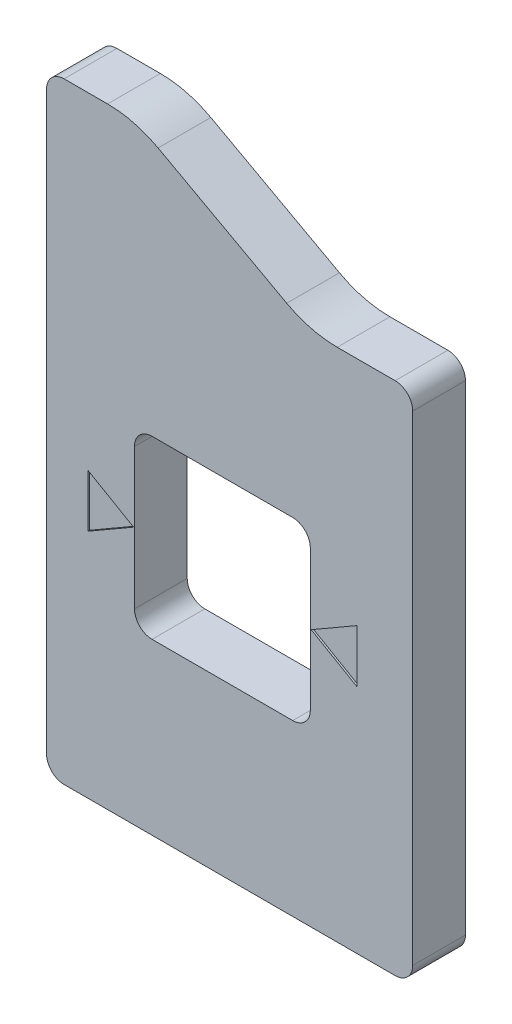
ISO-10303-21;
HEADER;
FILE_DESCRIPTION(('STEP AP214'),'2;1');
FILE_NAME('part.step','',(''),(''),'','','');
FILE_SCHEMA(('AUTOMOTIVE_DESIGN { 1 0 10303 214 1 1 1 1 }'));
ENDSEC;
DATA;
#1=APPLICATION_CONTEXT('core data for automotive mechanical design processes');
#2=APPLICATION_PROTOCOL_DEFINITION('international standard','automotive_design',2000,#1);
#3=PRODUCT_CONTEXT('',#1,'mechanical');
#4=PRODUCT('Part','Part','',(#3));
#5=PRODUCT_RELATED_PRODUCT_CATEGORY('part','',(#4));
#6=PRODUCT_DEFINITION_FORMATION('','',#4);
#7=PRODUCT_DEFINITION_CONTEXT('part definition',#1,'design');
#8=PRODUCT_DEFINITION('design','',#6,#7);
#9=PRODUCT_DEFINITION_SHAPE('','',#8);
#10=(LENGTH_UNIT() NAMED_UNIT(*) SI_UNIT(.MILLI.,.METRE.));
#11=(NAMED_UNIT(*) PLANE_ANGLE_UNIT() SI_UNIT($,.RADIAN.));
#12=(NAMED_UNIT(*) SI_UNIT($,.STERADIAN.) SOLID_ANGLE_UNIT());
#13=UNCERTAINTY_MEASURE_WITH_UNIT(LENGTH_MEASURE(1.E-05),#10,'distance_accuracy_value','');
#14=(GEOMETRIC_REPRESENTATION_CONTEXT(3) GLOBAL_UNCERTAINTY_ASSIGNED_CONTEXT((#13)) GLOBAL_UNIT_ASSIGNED_CONTEXT((#10,
#11,#12)) REPRESENTATION_CONTEXT('',''));
#15=CARTESIAN_POINT('',(0.,0.,0.));
#16=DIRECTION('',(0.,0.,1.));
#17=DIRECTION('',(1.,0.,0.));
#18=AXIS2_PLACEMENT_3D('',#15,#16,#17);
#19=CARTESIAN_POINT('',(14.8224463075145,-41.665103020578,6.));
#20=DIRECTION('',(0.,0.,1.));
#21=DIRECTION('',(1.,0.,0.));
#22=AXIS2_PLACEMENT_3D('',#19,#20,#21);
#23=PLANE('',#22);
#24=DIRECTION('',(0.866025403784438,0.500000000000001,0.));
#25=VECTOR('',#24,1.);
#26=CARTESIAN_POINT('',(-2.64807621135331,-29.5143211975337,6.));
#27=LINE('',#26,#25);
#28=CARTESIAN_POINT('',(-2.64807621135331,-29.5143211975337,6.));
#29=VERTEX_POINT('',#28);
#30=CARTESIAN_POINT('',(-0.049999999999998,-28.0143211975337,6.));
#31=VERTEX_POINT('',#30);
#32=EDGE_CURVE('E48',#29,#31,#27,.T.);
#33=ORIENTED_EDGE('',*,*,#32,.F.);
#34=DIRECTION('',(0.,-1.,0.));
#35=VECTOR('',#34,1.);
#36=CARTESIAN_POINT('',(-2.64807621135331,-26.5143211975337,6.));
#37=LINE('',#36,#35);
#38=CARTESIAN_POINT('',(-2.64807621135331,-26.5143211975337,6.));
#39=VERTEX_POINT('',#38);
#40=EDGE_CURVE('E223',#39,#29,#37,.T.);
#41=ORIENTED_EDGE('',*,*,#40,.F.);
#42=DIRECTION('',(-0.866025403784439,0.499999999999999,0.));
#43=VECTOR('',#42,1.);
#44=CARTESIAN_POINT('',(-0.0499999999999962,-28.0143211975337,6.));
#45=LINE('',#44,#43);
#46=EDGE_CURVE('E226',#31,#39,#45,.T.);
#47=ORIENTED_EDGE('',*,*,#46,.F.);
#48=EDGE_LOOP('',(#33,#41,#47));
#49=FACE_BOUND('',#48,.T.);
#50=DIRECTION('',(0.,1.,0.));
#51=VECTOR('',#50,1.);
#52=CARTESIAN_POINT('',(12.6480762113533,-26.5143211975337,6.));
#53=LINE('',#52,#51);
#54=CARTESIAN_POINT('',(12.6480762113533,-29.5143211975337,6.));
#55=VERTEX_POINT('',#54);
#56=CARTESIAN_POINT('',(12.6480762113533,-26.5143211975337,6.));
#57=VERTEX_POINT('',#56);
#58=EDGE_CURVE('E56',#55,#57,#53,.T.);
#59=ORIENTED_EDGE('',*,*,#58,.F.);
#60=DIRECTION('',(0.866025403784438,-0.500000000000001,0.));
#61=VECTOR('',#60,1.);
#62=CARTESIAN_POINT('',(12.6480762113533,-29.5143211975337,6.));
#63=LINE('',#62,#61);
#64=CARTESIAN_POINT('',(10.05,-28.0143211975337,6.));
#65=VERTEX_POINT('',#64);
#66=EDGE_CURVE('E241',#65,#55,#63,.T.);
#67=ORIENTED_EDGE('',*,*,#66,.F.);
#68=DIRECTION('',(-0.866025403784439,-0.5,0.));
#69=VECTOR('',#68,1.);
#70=CARTESIAN_POINT('',(10.05,-28.0143211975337,6.));
#71=LINE('',#70,#69);
#72=EDGE_CURVE('E249',#57,#65,#71,.T.);
#73=ORIENTED_EDGE('',*,*,#72,.F.);
#74=EDGE_LOOP('',(#59,#67,#73));
#75=FACE_BOUND('',#74,.T.);
#76=CARTESIAN_POINT('',(14.8224463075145,-41.665103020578,6.));
#77=DIRECTION('',(0.,0.,1.));
#78=DIRECTION('',(1.,0.,0.));
#79=AXIS2_PLACEMENT_3D('',#76,#77,#78);
#80=CIRCLE('',#79,1.);
#81=CARTESIAN_POINT('',(14.8224463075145,-42.665103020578,6.));
#82=VERTEX_POINT('',#81);
#83=CARTESIAN_POINT('',(15.8224463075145,-41.665103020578,6.));
#84=VERTEX_POINT('',#83);
#85=EDGE_CURVE('E317',#82,#84,#80,.T.);
#86=ORIENTED_EDGE('',*,*,#85,.T.);
#87=DIRECTION('',(0.,1.,0.));
#88=VECTOR('',#87,1.);
#89=CARTESIAN_POINT('',(15.8224463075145,-41.665103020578,6.));
#90=LINE('',#89,#88);
#91=CARTESIAN_POINT('',(15.8224463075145,-14.3635393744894,6.));
#92=VERTEX_POINT('',#91);
#93=EDGE_CURVE('E320',#84,#92,#90,.T.);
#94=ORIENTED_EDGE('',*,*,#93,.T.);
#95=CARTESIAN_POINT('',(14.8224463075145,-14.3635393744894,6.));
#96=DIRECTION('',(0.,0.,1.));
#97=DIRECTION('',(1.,0.,0.));
#98=AXIS2_PLACEMENT_3D('',#95,#96,#97);
#99=CIRCLE('',#98,1.);
#100=CARTESIAN_POINT('',(14.8224463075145,-13.3635393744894,6.));
#101=VERTEX_POINT('',#100);
#102=EDGE_CURVE('E323',#92,#101,#99,.T.);
#103=ORIENTED_EDGE('',*,*,#102,.T.);
#104=DIRECTION('',(-1.,0.,0.));
#105=VECTOR('',#104,1.);
#106=CARTESIAN_POINT('',(14.8224463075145,-13.3635393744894,6.));
#107=LINE('',#106,#105);
#108=CARTESIAN_POINT('',(11.52974146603,-13.3635393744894,6.));
#109=VERTEX_POINT('',#108);
#110=EDGE_CURVE('E325',#101,#109,#107,.T.);
#111=ORIENTED_EDGE('',*,*,#110,.T.);
#112=CARTESIAN_POINT('',(11.52974146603,-7.36353937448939,6.));
#113=DIRECTION('',(0.,0.,-1.));
#114=DIRECTION('',(-1.,0.,0.));
#115=AXIS2_PLACEMENT_3D('',#112,#113,#114);
#116=CIRCLE('',#115,6.);
#117=CARTESIAN_POINT('',(8.65699570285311,-12.6311129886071,6.));
#118=VERTEX_POINT('',#117);
#119=EDGE_CURVE('E327',#109,#118,#116,.T.);
#120=ORIENTED_EDGE('',*,*,#119,.T.);
#121=DIRECTION('',(-0.877928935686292,0.478790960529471,0.));
#122=VECTOR('',#121,1.);
#123=CARTESIAN_POINT('',(1.34300429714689,-8.64232434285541,6.));
#124=LINE('',#123,#122);
#125=CARTESIAN_POINT('',(1.34300429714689,-8.64232434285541,6.));
#126=VERTEX_POINT('',#125);
#127=EDGE_CURVE('E329',#118,#126,#124,.T.);
#128=ORIENTED_EDGE('',*,*,#127,.T.);
#129=CARTESIAN_POINT('',(-1.52974146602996,-13.9098979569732,6.));
#130=DIRECTION('',(0.,0.,1.));
#131=DIRECTION('',(-1.,0.,0.));
#132=AXIS2_PLACEMENT_3D('',#129,#130,#131);
#133=CIRCLE('',#132,6.);
#134=CARTESIAN_POINT('',(-1.52974146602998,-7.90989795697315,6.));
#135=VERTEX_POINT('',#134);
#136=EDGE_CURVE('E331',#126,#135,#133,.T.);
#137=ORIENTED_EDGE('',*,*,#136,.T.);
#138=DIRECTION('',(-1.,0.,0.));
#139=VECTOR('',#138,1.);
#140=CARTESIAN_POINT('',(-1.52974146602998,-7.90989795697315,6.));
#141=LINE('',#140,#139);
#142=CARTESIAN_POINT('',(-4.,-7.90989795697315,6.));
#143=VERTEX_POINT('',#142);
#144=EDGE_CURVE('E333',#135,#143,#141,.T.);
#145=ORIENTED_EDGE('',*,*,#144,.T.);
#146=CARTESIAN_POINT('',(-4.,-8.90989795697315,6.));
#147=DIRECTION('',(0.,0.,1.));
#148=DIRECTION('',(1.,0.,0.));
#149=AXIS2_PLACEMENT_3D('',#146,#147,#148);
#150=CIRCLE('',#149,1.);
#151=CARTESIAN_POINT('',(-5.,-8.90989795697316,6.));
#152=VERTEX_POINT('',#151);
#153=EDGE_CURVE('E335',#143,#152,#150,.T.);
#154=ORIENTED_EDGE('',*,*,#153,.T.);
#155=DIRECTION('',(0.,-1.,0.));
#156=VECTOR('',#155,1.);
#157=CARTESIAN_POINT('',(-5.,-8.90989795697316,6.));
#158=LINE('',#157,#156);
#159=CARTESIAN_POINT('',(-5.,-41.665103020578,6.));
#160=VERTEX_POINT('',#159);
#161=EDGE_CURVE('E337',#152,#160,#158,.T.);
#162=ORIENTED_EDGE('',*,*,#161,.T.);
#163=CARTESIAN_POINT('',(-4.,-41.665103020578,6.));
#164=DIRECTION('',(0.,0.,1.));
#165=DIRECTION('',(1.,0.,0.));
#166=AXIS2_PLACEMENT_3D('',#163,#164,#165);
#167=CIRCLE('',#166,1.);
#168=CARTESIAN_POINT('',(-4.,-42.665103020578,6.));
#169=VERTEX_POINT('',#168);
#170=EDGE_CURVE('E339',#160,#169,#167,.T.);
#171=ORIENTED_EDGE('',*,*,#170,.T.);
#172=DIRECTION('',(1.,0.,0.));
#173=VECTOR('',#172,1.);
#174=CARTESIAN_POINT('',(-4.,-42.665103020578,6.));
#175=LINE('',#174,#173);
#176=EDGE_CURVE('E341',#169,#82,#175,.T.);
#177=ORIENTED_EDGE('',*,*,#176,.T.);
#178=EDGE_LOOP('',(#86,#94,#103,#111,#120,#128,#137,#145,#154,#162,#171,#177));
#179=FACE_BOUND('',#178,.T.);
#180=DIRECTION('',(1.,0.,0.));
#181=VECTOR('',#180,1.);
#182=CARTESIAN_POINT('',(1.,-33.0143211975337,6.));
#183=LINE('',#182,#181);
#184=CARTESIAN_POINT('',(1.,-33.0143211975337,6.));
#185=VERTEX_POINT('',#184);
#186=CARTESIAN_POINT('',(9.00000000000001,-33.0143211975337,6.));
#187=VERTEX_POINT('',#186);
#188=EDGE_CURVE('E260',#185,#187,#183,.T.);
#189=ORIENTED_EDGE('',*,*,#188,.F.);
#190=CARTESIAN_POINT('',(1.,-32.0143211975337,6.));
#191=DIRECTION('',(0.,0.,1.));
#192=DIRECTION('',(1.,0.,0.));
#193=AXIS2_PLACEMENT_3D('',#190,#191,#192);
#194=CIRCLE('',#193,1.);
#195=CARTESIAN_POINT('',(0.,-32.0143211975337,6.));
#196=VERTEX_POINT('',#195);
#197=EDGE_CURVE('E258',#196,#185,#194,.T.);
#198=ORIENTED_EDGE('',*,*,#197,.F.);
#199=DIRECTION('',(0.,-1.,0.));
#200=VECTOR('',#199,1.);
#201=CARTESIAN_POINT('',(0.,-24.0143211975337,6.));
#202=LINE('',#201,#200);
#203=CARTESIAN_POINT('',(0.,-24.0143211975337,6.));
#204=VERTEX_POINT('',#203);
#205=EDGE_CURVE('E274',#204,#196,#202,.T.);
#206=ORIENTED_EDGE('',*,*,#205,.F.);
#207=CARTESIAN_POINT('',(1.,-24.0143211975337,6.));
#208=DIRECTION('',(0.,0.,1.));
#209=DIRECTION('',(1.,0.,0.));
#210=AXIS2_PLACEMENT_3D('',#207,#208,#209);
#211=CIRCLE('',#210,1.);
#212=CARTESIAN_POINT('',(1.,-23.0143211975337,6.));
#213=VERTEX_POINT('',#212);
#214=EDGE_CURVE('E271',#213,#204,#211,.T.);
#215=ORIENTED_EDGE('',*,*,#214,.F.);
#216=DIRECTION('',(-1.,0.,0.));
#217=VECTOR('',#216,1.);
#218=CARTESIAN_POINT('',(1.,-23.0143211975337,6.));
#219=LINE('',#218,#217);
#220=CARTESIAN_POINT('',(9.00000000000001,-23.0143211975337,6.));
#221=VERTEX_POINT('',#220);
#222=EDGE_CURVE('E269',#221,#213,#219,.T.);
#223=ORIENTED_EDGE('',*,*,#222,.F.);
#224=CARTESIAN_POINT('',(9.00000000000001,-24.0143211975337,6.));
#225=DIRECTION('',(0.,0.,1.));
#226=DIRECTION('',(-1.,0.,0.));
#227=AXIS2_PLACEMENT_3D('',#224,#225,#226);
#228=CIRCLE('',#227,1.);
#229=CARTESIAN_POINT('',(10.,-24.0143211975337,6.));
#230=VERTEX_POINT('',#229);
#231=EDGE_CURVE('E267',#230,#221,#228,.T.);
#232=ORIENTED_EDGE('',*,*,#231,.F.);
#233=DIRECTION('',(0.,1.,0.));
#234=VECTOR('',#233,1.);
#235=CARTESIAN_POINT('',(10.,-24.0143211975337,6.));
#236=LINE('',#235,#234);
#237=CARTESIAN_POINT('',(10.,-32.0143211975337,6.));
#238=VERTEX_POINT('',#237);
#239=EDGE_CURVE('E265',#238,#230,#236,.T.);
#240=ORIENTED_EDGE('',*,*,#239,.F.);
#241=CARTESIAN_POINT('',(9.00000000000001,-32.0143211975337,6.));
#242=DIRECTION('',(0.,0.,1.));
#243=DIRECTION('',(1.,0.,0.));
#244=AXIS2_PLACEMENT_3D('',#241,#242,#243);
#245=CIRCLE('',#244,1.);
#246=EDGE_CURVE('E263',#187,#238,#245,.T.);
#247=ORIENTED_EDGE('',*,*,#246,.F.);
#248=EDGE_LOOP('',(#189,#198,#206,#215,#223,#232,#240,#247));
#249=FACE_BOUND('',#248,.T.);
#250=ADVANCED_FACE('F33',(#49,#75,#179,#249),#23,.T.);
#251=CARTESIAN_POINT('',(14.8224463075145,-41.665103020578,3.));
#252=DIRECTION('',(0.,0.,1.));
#253=DIRECTION('',(1.,0.,0.));
#254=AXIS2_PLACEMENT_3D('',#251,#252,#253);
#255=PLANE('',#254);
#256=CARTESIAN_POINT('',(14.8224463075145,-41.665103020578,3.));
#257=DIRECTION('',(0.,0.,1.));
#258=DIRECTION('',(1.,0.,0.));
#259=AXIS2_PLACEMENT_3D('',#256,#257,#258);
#260=CIRCLE('',#259,1.);
#261=CARTESIAN_POINT('',(14.8224463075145,-42.665103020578,3.));
#262=VERTEX_POINT('',#261);
#263=CARTESIAN_POINT('',(15.8224463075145,-41.665103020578,3.));
#264=VERTEX_POINT('',#263);
#265=EDGE_CURVE('E316',#262,#264,#260,.T.);
#266=ORIENTED_EDGE('',*,*,#265,.F.);
#267=DIRECTION('',(1.,0.,0.));
#268=VECTOR('',#267,1.);
#269=CARTESIAN_POINT('',(-4.,-42.665103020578,3.));
#270=LINE('',#269,#268);
#271=CARTESIAN_POINT('',(-4.,-42.665103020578,3.));
#272=VERTEX_POINT('',#271);
#273=EDGE_CURVE('E321',#272,#262,#270,.T.);
#274=ORIENTED_EDGE('',*,*,#273,.F.);
#275=CARTESIAN_POINT('',(-4.,-41.665103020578,3.));
#276=DIRECTION('',(0.,0.,1.));
#277=DIRECTION('',(1.,0.,0.));
#278=AXIS2_PLACEMENT_3D('',#275,#276,#277);
#279=CIRCLE('',#278,1.);
#280=CARTESIAN_POINT('',(-5.,-41.665103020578,3.));
#281=VERTEX_POINT('',#280);
#282=EDGE_CURVE('E364',#281,#272,#279,.T.);
#283=ORIENTED_EDGE('',*,*,#282,.F.);
#284=DIRECTION('',(0.,-1.,0.));
#285=VECTOR('',#284,1.);
#286=CARTESIAN_POINT('',(-5.,-8.90989795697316,3.));
#287=LINE('',#286,#285);
#288=CARTESIAN_POINT('',(-5.,-8.90989795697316,3.));
#289=VERTEX_POINT('',#288);
#290=EDGE_CURVE('E362',#289,#281,#287,.T.);
#291=ORIENTED_EDGE('',*,*,#290,.F.);
#292=CARTESIAN_POINT('',(-4.,-8.90989795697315,3.));
#293=DIRECTION('',(0.,0.,1.));
#294=DIRECTION('',(1.,0.,0.));
#295=AXIS2_PLACEMENT_3D('',#292,#293,#294);
#296=CIRCLE('',#295,1.);
#297=CARTESIAN_POINT('',(-4.,-7.90989795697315,3.));
#298=VERTEX_POINT('',#297);
#299=EDGE_CURVE('E360',#298,#289,#296,.T.);
#300=ORIENTED_EDGE('',*,*,#299,.F.);
#301=DIRECTION('',(-1.,0.,0.));
#302=VECTOR('',#301,1.);
#303=CARTESIAN_POINT('',(-1.52974146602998,-7.90989795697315,3.));
#304=LINE('',#303,#302);
#305=CARTESIAN_POINT('',(-1.52974146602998,-7.90989795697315,3.));
#306=VERTEX_POINT('',#305);
#307=EDGE_CURVE('E358',#306,#298,#304,.T.);
#308=ORIENTED_EDGE('',*,*,#307,.F.);
#309=CARTESIAN_POINT('',(-1.52974146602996,-13.9098979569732,3.));
#310=DIRECTION('',(0.,0.,1.));
#311=DIRECTION('',(-1.,0.,0.));
#312=AXIS2_PLACEMENT_3D('',#309,#310,#311);
#313=CIRCLE('',#312,6.);
#314=CARTESIAN_POINT('',(1.34300429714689,-8.64232434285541,3.));
#315=VERTEX_POINT('',#314);
#316=EDGE_CURVE('E356',#315,#306,#313,.T.);
#317=ORIENTED_EDGE('',*,*,#316,.F.);
#318=DIRECTION('',(-0.877928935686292,0.478790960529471,0.));
#319=VECTOR('',#318,1.);
#320=CARTESIAN_POINT('',(1.34300429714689,-8.64232434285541,3.));
#321=LINE('',#320,#319);
#322=CARTESIAN_POINT('',(8.65699570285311,-12.6311129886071,3.));
#323=VERTEX_POINT('',#322);
#324=EDGE_CURVE('E354',#323,#315,#321,.T.);
#325=ORIENTED_EDGE('',*,*,#324,.F.);
#326=CARTESIAN_POINT('',(11.52974146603,-7.36353937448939,3.));
#327=DIRECTION('',(0.,0.,-1.));
#328=DIRECTION('',(-1.,0.,0.));
#329=AXIS2_PLACEMENT_3D('',#326,#327,#328);
#330=CIRCLE('',#329,6.);
#331=CARTESIAN_POINT('',(11.52974146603,-13.3635393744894,3.));
#332=VERTEX_POINT('',#331);
#333=EDGE_CURVE('E352',#332,#323,#330,.T.);
#334=ORIENTED_EDGE('',*,*,#333,.F.);
#335=DIRECTION('',(-1.,0.,0.));
#336=VECTOR('',#335,1.);
#337=CARTESIAN_POINT('',(14.8224463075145,-13.3635393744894,3.));
#338=LINE('',#337,#336);
#339=CARTESIAN_POINT('',(14.8224463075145,-13.3635393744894,3.));
#340=VERTEX_POINT('',#339);
#341=EDGE_CURVE('E350',#340,#332,#338,.T.);
#342=ORIENTED_EDGE('',*,*,#341,.F.);
#343=CARTESIAN_POINT('',(14.8224463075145,-14.3635393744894,3.));
#344=DIRECTION('',(0.,0.,1.));
#345=DIRECTION('',(1.,0.,0.));
#346=AXIS2_PLACEMENT_3D('',#343,#344,#345);
#347=CIRCLE('',#346,1.);
#348=CARTESIAN_POINT('',(15.8224463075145,-14.3635393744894,3.));
#349=VERTEX_POINT('',#348);
#350=EDGE_CURVE('E348',#349,#340,#347,.T.);
#351=ORIENTED_EDGE('',*,*,#350,.F.);
#352=DIRECTION('',(0.,1.,0.));
#353=VECTOR('',#352,1.);
#354=CARTESIAN_POINT('',(15.8224463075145,-41.665103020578,3.));
#355=LINE('',#354,#353);
#356=EDGE_CURVE('E346',#264,#349,#355,.T.);
#357=ORIENTED_EDGE('',*,*,#356,.F.);
#358=EDGE_LOOP('',(#266,#274,#283,#291,#300,#308,#317,#325,#334,#342,#351,#357));
#359=FACE_BOUND('',#358,.T.);
#360=CARTESIAN_POINT('',(1.,-32.0143211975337,3.));
#361=DIRECTION('',(0.,0.,1.));
#362=DIRECTION('',(1.,0.,0.));
#363=AXIS2_PLACEMENT_3D('',#360,#361,#362);
#364=CIRCLE('',#363,1.);
#365=CARTESIAN_POINT('',(0.,-32.0143211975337,3.));
#366=VERTEX_POINT('',#365);
#367=CARTESIAN_POINT('',(1.,-33.0143211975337,3.));
#368=VERTEX_POINT('',#367);
#369=EDGE_CURVE('E235',#366,#368,#364,.T.);
#370=ORIENTED_EDGE('',*,*,#369,.T.);
#371=DIRECTION('',(1.,0.,0.));
#372=VECTOR('',#371,1.);
#373=CARTESIAN_POINT('',(1.,-33.0143211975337,3.));
#374=LINE('',#373,#372);
#375=CARTESIAN_POINT('',(9.00000000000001,-33.0143211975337,3.));
#376=VERTEX_POINT('',#375);
#377=EDGE_CURVE('E279',#368,#376,#374,.T.);
#378=ORIENTED_EDGE('',*,*,#377,.T.);
#379=CARTESIAN_POINT('',(9.00000000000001,-32.0143211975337,3.));
#380=DIRECTION('',(0.,0.,1.));
#381=DIRECTION('',(1.,0.,0.));
#382=AXIS2_PLACEMENT_3D('',#379,#380,#381);
#383=CIRCLE('',#382,1.);
#384=CARTESIAN_POINT('',(10.,-32.0143211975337,3.));
#385=VERTEX_POINT('',#384);
#386=EDGE_CURVE('E282',#376,#385,#383,.T.);
#387=ORIENTED_EDGE('',*,*,#386,.T.);
#388=DIRECTION('',(0.,1.,0.));
#389=VECTOR('',#388,1.);
#390=CARTESIAN_POINT('',(10.,-24.0143211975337,3.));
#391=LINE('',#390,#389);
#392=CARTESIAN_POINT('',(10.,-24.0143211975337,3.));
#393=VERTEX_POINT('',#392);
#394=EDGE_CURVE('E285',#385,#393,#391,.T.);
#395=ORIENTED_EDGE('',*,*,#394,.T.);
#396=CARTESIAN_POINT('',(9.00000000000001,-24.0143211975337,3.));
#397=DIRECTION('',(0.,0.,1.));
#398=DIRECTION('',(-1.,0.,0.));
#399=AXIS2_PLACEMENT_3D('',#396,#397,#398);
#400=CIRCLE('',#399,1.);
#401=CARTESIAN_POINT('',(9.00000000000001,-23.0143211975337,3.));
#402=VERTEX_POINT('',#401);
#403=EDGE_CURVE('E288',#393,#402,#400,.T.);
#404=ORIENTED_EDGE('',*,*,#403,.T.);
#405=DIRECTION('',(-1.,0.,0.));
#406=VECTOR('',#405,1.);
#407=CARTESIAN_POINT('',(1.,-23.0143211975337,3.));
#408=LINE('',#407,#406);
#409=CARTESIAN_POINT('',(1.,-23.0143211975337,3.));
#410=VERTEX_POINT('',#409);
#411=EDGE_CURVE('E291',#402,#410,#408,.T.);
#412=ORIENTED_EDGE('',*,*,#411,.T.);
#413=CARTESIAN_POINT('',(1.,-24.0143211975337,3.));
#414=DIRECTION('',(0.,0.,1.));
#415=DIRECTION('',(1.,0.,0.));
#416=AXIS2_PLACEMENT_3D('',#413,#414,#415);
#417=CIRCLE('',#416,1.);
#418=CARTESIAN_POINT('',(0.,-24.0143211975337,3.));
#419=VERTEX_POINT('',#418);
#420=EDGE_CURVE('E294',#410,#419,#417,.T.);
#421=ORIENTED_EDGE('',*,*,#420,.T.);
#422=DIRECTION('',(0.,-1.,0.));
#423=VECTOR('',#422,1.);
#424=CARTESIAN_POINT('',(0.,-24.0143211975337,3.));
#425=LINE('',#424,#423);
#426=EDGE_CURVE('E261',#419,#366,#425,.T.);
#427=ORIENTED_EDGE('',*,*,#426,.T.);
#428=EDGE_LOOP('',(#370,#378,#387,#395,#404,#412,#421,#427));
#429=FACE_BOUND('',#428,.T.);
#430=ADVANCED_FACE('F406',(#359,#429),#255,.F.);
#431=CARTESIAN_POINT('',(14.8224463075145,-41.665103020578,6.));
#432=DIRECTION('',(0.,0.,-1.));
#433=DIRECTION('',(-1.,0.,0.));
#434=AXIS2_PLACEMENT_3D('',#431,#432,#433);
#435=CYLINDRICAL_SURFACE('',#434,1.);
#436=ORIENTED_EDGE('',*,*,#265,.T.);
#437=DIRECTION('',(0.,0.,-1.));
#438=VECTOR('',#437,1.);
#439=CARTESIAN_POINT('',(15.8224463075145,-41.665103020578,6.));
#440=LINE('',#439,#438);
#441=EDGE_CURVE('E11',#84,#264,#440,.T.);
#442=ORIENTED_EDGE('',*,*,#441,.F.);
#443=ORIENTED_EDGE('',*,*,#85,.F.);
#444=DIRECTION('',(0.,0.,-1.));
#445=VECTOR('',#444,1.);
#446=CARTESIAN_POINT('',(14.8224463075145,-42.665103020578,6.));
#447=LINE('',#446,#445);
#448=EDGE_CURVE('E343',#82,#262,#447,.T.);
#449=ORIENTED_EDGE('',*,*,#448,.T.);
#450=EDGE_LOOP('',(#436,#442,#443,#449));
#451=FACE_BOUND('',#450,.T.);
#452=ADVANCED_FACE('F35',(#451),#435,.T.);
#453=CARTESIAN_POINT('',(15.8224463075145,-41.665103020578,6.));
#454=DIRECTION('',(-1.,0.,0.));
#455=DIRECTION('',(0.,-1.,0.));
#456=AXIS2_PLACEMENT_3D('',#453,#454,#455);
#457=PLANE('',#456);
#458=ORIENTED_EDGE('',*,*,#356,.T.);
#459=DIRECTION('',(0.,0.,-1.));
#460=VECTOR('',#459,1.);
#461=CARTESIAN_POINT('',(15.8224463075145,-14.3635393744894,6.));
#462=LINE('',#461,#460);
#463=EDGE_CURVE('E41',#92,#349,#462,.T.);
#464=ORIENTED_EDGE('',*,*,#463,.F.);
#465=ORIENTED_EDGE('',*,*,#93,.F.);
#466=ORIENTED_EDGE('',*,*,#441,.T.);
#467=EDGE_LOOP('',(#458,#464,#465,#466));
#468=FACE_BOUND('',#467,.T.);
#469=ADVANCED_FACE('F424',(#468),#457,.F.);
#470=CARTESIAN_POINT('',(14.8224463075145,-14.3635393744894,6.));
#471=DIRECTION('',(0.,0.,-1.));
#472=DIRECTION('',(-1.,0.,0.));
#473=AXIS2_PLACEMENT_3D('',#470,#471,#472);
#474=CYLINDRICAL_SURFACE('',#473,1.);
#475=ORIENTED_EDGE('',*,*,#350,.T.);
#476=DIRECTION('',(0.,0.,-1.));
#477=VECTOR('',#476,1.);
#478=CARTESIAN_POINT('',(14.8224463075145,-13.3635393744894,6.));
#479=LINE('',#478,#477);
#480=EDGE_CURVE('E393',#101,#340,#479,.T.);
#481=ORIENTED_EDGE('',*,*,#480,.F.);
#482=ORIENTED_EDGE('',*,*,#102,.F.);
#483=ORIENTED_EDGE('',*,*,#463,.T.);
#484=EDGE_LOOP('',(#475,#481,#482,#483));
#485=FACE_BOUND('',#484,.T.);
#486=ADVANCED_FACE('F400',(#485),#474,.T.);
#487=CARTESIAN_POINT('',(14.8224463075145,-13.3635393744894,6.));
#488=DIRECTION('',(0.,-1.,0.));
#489=DIRECTION('',(1.,0.,0.));
#490=AXIS2_PLACEMENT_3D('',#487,#488,#489);
#491=PLANE('',#490);
#492=ORIENTED_EDGE('',*,*,#341,.T.);
#493=DIRECTION('',(0.,0.,-1.));
#494=VECTOR('',#493,1.);
#495=CARTESIAN_POINT('',(11.52974146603,-13.3635393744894,6.));
#496=LINE('',#495,#494);
#497=EDGE_CURVE('E390',#109,#332,#496,.T.);
#498=ORIENTED_EDGE('',*,*,#497,.F.);
#499=ORIENTED_EDGE('',*,*,#110,.F.);
#500=ORIENTED_EDGE('',*,*,#480,.T.);
#501=EDGE_LOOP('',(#492,#498,#499,#500));
#502=FACE_BOUND('',#501,.T.);
#503=ADVANCED_FACE('F412',(#502),#491,.F.);
#504=CARTESIAN_POINT('',(11.52974146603,-7.36353937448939,6.));
#505=DIRECTION('',(0.,0.,-1.));
#506=DIRECTION('',(-1.,0.,0.));
#507=AXIS2_PLACEMENT_3D('',#504,#505,#506);
#508=CYLINDRICAL_SURFACE('',#507,6.);
#509=ORIENTED_EDGE('',*,*,#333,.T.);
#510=DIRECTION('',(0.,0.,-1.));
#511=VECTOR('',#510,1.);
#512=CARTESIAN_POINT('',(8.65699570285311,-12.6311129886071,6.));
#513=LINE('',#512,#511);
#514=EDGE_CURVE('E387',#118,#323,#513,.T.);
#515=ORIENTED_EDGE('',*,*,#514,.F.);
#516=ORIENTED_EDGE('',*,*,#119,.F.);
#517=ORIENTED_EDGE('',*,*,#497,.T.);
#518=EDGE_LOOP('',(#509,#515,#516,#517));
#519=FACE_BOUND('',#518,.T.);
#520=ADVANCED_FACE('F416',(#519),#508,.F.);
#521=CARTESIAN_POINT('',(1.34300429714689,-8.64232434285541,6.));
#522=DIRECTION('',(-0.478790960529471,-0.877928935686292,0.));
#523=DIRECTION('',(0.877928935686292,-0.478790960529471,0.));
#524=AXIS2_PLACEMENT_3D('',#521,#522,#523);
#525=PLANE('',#524);
#526=ORIENTED_EDGE('',*,*,#324,.T.);
#527=DIRECTION('',(0.,0.,-1.));
#528=VECTOR('',#527,1.);
#529=CARTESIAN_POINT('',(1.34300429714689,-8.64232434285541,6.));
#530=LINE('',#529,#528);
#531=EDGE_CURVE('E384',#126,#315,#530,.T.);
#532=ORIENTED_EDGE('',*,*,#531,.F.);
#533=ORIENTED_EDGE('',*,*,#127,.F.);
#534=ORIENTED_EDGE('',*,*,#514,.T.);
#535=EDGE_LOOP('',(#526,#532,#533,#534));
#536=FACE_BOUND('',#535,.T.);
#537=ADVANCED_FACE('F457',(#536),#525,.F.);
#538=CARTESIAN_POINT('',(-1.52974146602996,-13.9098979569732,6.));
#539=DIRECTION('',(0.,0.,-1.));
#540=DIRECTION('',(-1.,0.,0.));
#541=AXIS2_PLACEMENT_3D('',#538,#539,#540);
#542=CYLINDRICAL_SURFACE('',#541,6.);
#543=ORIENTED_EDGE('',*,*,#316,.T.);
#544=DIRECTION('',(0.,0.,-1.));
#545=VECTOR('',#544,1.);
#546=CARTESIAN_POINT('',(-1.52974146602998,-7.90989795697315,6.));
#547=LINE('',#546,#545);
#548=EDGE_CURVE('E381',#135,#306,#547,.T.);
#549=ORIENTED_EDGE('',*,*,#548,.F.);
#550=ORIENTED_EDGE('',*,*,#136,.F.);
#551=ORIENTED_EDGE('',*,*,#531,.T.);
#552=EDGE_LOOP('',(#543,#549,#550,#551));
#553=FACE_BOUND('',#552,.T.);
#554=ADVANCED_FACE('F455',(#553),#542,.T.);
#555=CARTESIAN_POINT('',(-1.52974146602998,-7.90989795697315,6.));
#556=DIRECTION('',(0.,-1.,0.));
#557=DIRECTION('',(0.,0.,-1.));
#558=AXIS2_PLACEMENT_3D('',#555,#556,#557);
#559=PLANE('',#558);
#560=ORIENTED_EDGE('',*,*,#307,.T.);
#561=DIRECTION('',(0.,0.,-1.));
#562=VECTOR('',#561,1.);
#563=CARTESIAN_POINT('',(-4.,-7.90989795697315,6.));
#564=LINE('',#563,#562);
#565=EDGE_CURVE('E378',#143,#298,#564,.T.);
#566=ORIENTED_EDGE('',*,*,#565,.F.);
#567=ORIENTED_EDGE('',*,*,#144,.F.);
#568=ORIENTED_EDGE('',*,*,#548,.T.);
#569=EDGE_LOOP('',(#560,#566,#567,#568));
#570=FACE_BOUND('',#569,.T.);
#571=ADVANCED_FACE('F451',(#570),#559,.F.);
#572=CARTESIAN_POINT('',(-4.,-8.90989795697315,6.));
#573=DIRECTION('',(0.,0.,-1.));
#574=DIRECTION('',(-1.,0.,0.));
#575=AXIS2_PLACEMENT_3D('',#572,#573,#574);
#576=CYLINDRICAL_SURFACE('',#575,1.);
#577=ORIENTED_EDGE('',*,*,#299,.T.);
#578=DIRECTION('',(0.,0.,-1.));
#579=VECTOR('',#578,1.);
#580=CARTESIAN_POINT('',(-5.,-8.90989795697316,6.));
#581=LINE('',#580,#579);
#582=EDGE_CURVE('E375',#152,#289,#581,.T.);
#583=ORIENTED_EDGE('',*,*,#582,.F.);
#584=ORIENTED_EDGE('',*,*,#153,.F.);
#585=ORIENTED_EDGE('',*,*,#565,.T.);
#586=EDGE_LOOP('',(#577,#583,#584,#585));
#587=FACE_BOUND('',#586,.T.);
#588=ADVANCED_FACE('F446',(#587),#576,.T.);
#589=CARTESIAN_POINT('',(-5.,-8.90989795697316,6.));
#590=DIRECTION('',(1.,0.,0.));
#591=DIRECTION('',(0.,0.,-1.));
#592=AXIS2_PLACEMENT_3D('',#589,#590,#591);
#593=PLANE('',#592);
#594=ORIENTED_EDGE('',*,*,#290,.T.);
#595=DIRECTION('',(0.,0.,-1.));
#596=VECTOR('',#595,1.);
#597=CARTESIAN_POINT('',(-5.,-41.665103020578,6.));
#598=LINE('',#597,#596);
#599=EDGE_CURVE('E372',#160,#281,#598,.T.);
#600=ORIENTED_EDGE('',*,*,#599,.F.);
#601=ORIENTED_EDGE('',*,*,#161,.F.);
#602=ORIENTED_EDGE('',*,*,#582,.T.);
#603=EDGE_LOOP('',(#594,#600,#601,#602));
#604=FACE_BOUND('',#603,.T.);
#605=ADVANCED_FACE('F440',(#604),#593,.F.);
#606=CARTESIAN_POINT('',(-4.,-41.665103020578,6.));
#607=DIRECTION('',(0.,0.,-1.));
#608=DIRECTION('',(-1.,0.,0.));
#609=AXIS2_PLACEMENT_3D('',#606,#607,#608);
#610=CYLINDRICAL_SURFACE('',#609,1.);
#611=ORIENTED_EDGE('',*,*,#282,.T.);
#612=DIRECTION('',(0.,0.,-1.));
#613=VECTOR('',#612,1.);
#614=CARTESIAN_POINT('',(-4.,-42.665103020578,6.));
#615=LINE('',#614,#613);
#616=EDGE_CURVE('E369',#169,#272,#615,.T.);
#617=ORIENTED_EDGE('',*,*,#616,.F.);
#618=ORIENTED_EDGE('',*,*,#170,.F.);
#619=ORIENTED_EDGE('',*,*,#599,.T.);
#620=EDGE_LOOP('',(#611,#617,#618,#619));
#621=FACE_BOUND('',#620,.T.);
#622=ADVANCED_FACE('F436',(#621),#610,.T.);
#623=CARTESIAN_POINT('',(-4.,-42.665103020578,6.));
#624=DIRECTION('',(0.,1.,0.));
#625=DIRECTION('',(0.,0.,1.));
#626=AXIS2_PLACEMENT_3D('',#623,#624,#625);
#627=PLANE('',#626);
#628=ORIENTED_EDGE('',*,*,#273,.T.);
#629=ORIENTED_EDGE('',*,*,#448,.F.);
#630=ORIENTED_EDGE('',*,*,#176,.F.);
#631=ORIENTED_EDGE('',*,*,#616,.T.);
#632=EDGE_LOOP('',(#628,#629,#630,#631));
#633=FACE_BOUND('',#632,.T.);
#634=ADVANCED_FACE('F431',(#633),#627,.F.);
#635=CARTESIAN_POINT('',(1.,-32.0143211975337,6.));
#636=DIRECTION('',(0.,0.,-1.));
#637=DIRECTION('',(-1.,0.,0.));
#638=AXIS2_PLACEMENT_3D('',#635,#636,#637);
#639=CYLINDRICAL_SURFACE('',#638,1.);
#640=ORIENTED_EDGE('',*,*,#369,.F.);
#641=DIRECTION('',(0.,0.,-1.));
#642=VECTOR('',#641,1.);
#643=CARTESIAN_POINT('',(0.,-32.0143211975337,6.));
#644=LINE('',#643,#642);
#645=EDGE_CURVE('E276',#196,#366,#644,.T.);
#646=ORIENTED_EDGE('',*,*,#645,.F.);
#647=ORIENTED_EDGE('',*,*,#197,.T.);
#648=DIRECTION('',(0.,0.,-1.));
#649=VECTOR('',#648,1.);
#650=CARTESIAN_POINT('',(1.,-33.0143211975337,6.));
#651=LINE('',#650,#649);
#652=EDGE_CURVE('E313',#185,#368,#651,.T.);
#653=ORIENTED_EDGE('',*,*,#652,.T.);
#654=EDGE_LOOP('',(#640,#646,#647,#653));
#655=FACE_BOUND('',#654,.T.);
#656=ADVANCED_FACE('F475',(#655),#639,.F.);
#657=CARTESIAN_POINT('',(1.,-33.0143211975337,6.));
#658=DIRECTION('',(0.,1.,0.));
#659=DIRECTION('',(0.,0.,1.));
#660=AXIS2_PLACEMENT_3D('',#657,#658,#659);
#661=PLANE('',#660);
#662=ORIENTED_EDGE('',*,*,#377,.F.);
#663=ORIENTED_EDGE('',*,*,#652,.F.);
#664=ORIENTED_EDGE('',*,*,#188,.T.);
#665=DIRECTION('',(0.,0.,-1.));
#666=VECTOR('',#665,1.);
#667=CARTESIAN_POINT('',(9.00000000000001,-33.0143211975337,6.));
#668=LINE('',#667,#666);
#669=EDGE_CURVE('E311',#187,#376,#668,.T.);
#670=ORIENTED_EDGE('',*,*,#669,.T.);
#671=EDGE_LOOP('',(#662,#663,#664,#670));
#672=FACE_BOUND('',#671,.T.);
#673=ADVANCED_FACE('F513',(#672),#661,.T.);
#674=CARTESIAN_POINT('',(9.00000000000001,-32.0143211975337,6.));
#675=DIRECTION('',(0.,0.,-1.));
#676=DIRECTION('',(-1.,0.,0.));
#677=AXIS2_PLACEMENT_3D('',#674,#675,#676);
#678=CYLINDRICAL_SURFACE('',#677,1.);
#679=ORIENTED_EDGE('',*,*,#386,.F.);
#680=ORIENTED_EDGE('',*,*,#669,.F.);
#681=ORIENTED_EDGE('',*,*,#246,.T.);
#682=DIRECTION('',(0.,0.,-1.));
#683=VECTOR('',#682,1.);
#684=CARTESIAN_POINT('',(10.,-32.0143211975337,6.));
#685=LINE('',#684,#683);
#686=EDGE_CURVE('E309',#238,#385,#685,.T.);
#687=ORIENTED_EDGE('',*,*,#686,.T.);
#688=EDGE_LOOP('',(#679,#680,#681,#687));
#689=FACE_BOUND('',#688,.T.);
#690=ADVANCED_FACE('F520',(#689),#678,.F.);
#691=CARTESIAN_POINT('',(10.,-24.0143211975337,6.));
#692=DIRECTION('',(-1.,0.,0.));
#693=DIRECTION('',(0.,-1.,0.));
#694=AXIS2_PLACEMENT_3D('',#691,#692,#693);
#695=PLANE('',#694);
#696=ORIENTED_EDGE('',*,*,#394,.F.);
#697=ORIENTED_EDGE('',*,*,#686,.F.);
#698=ORIENTED_EDGE('',*,*,#239,.T.);
#699=DIRECTION('',(0.,0.,-1.));
#700=VECTOR('',#699,1.);
#701=CARTESIAN_POINT('',(10.,-24.0143211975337,6.));
#702=LINE('',#701,#700);
#703=EDGE_CURVE('E307',#230,#393,#702,.T.);
#704=ORIENTED_EDGE('',*,*,#703,.T.);
#705=EDGE_LOOP('',(#696,#697,#698,#704));
#706=FACE_BOUND('',#705,.T.);
#707=ADVANCED_FACE('F527',(#706),#695,.T.);
#708=CARTESIAN_POINT('',(9.00000000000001,-24.0143211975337,6.));
#709=DIRECTION('',(0.,0.,-1.));
#710=DIRECTION('',(-1.,0.,0.));
#711=AXIS2_PLACEMENT_3D('',#708,#709,#710);
#712=CYLINDRICAL_SURFACE('',#711,1.);
#713=ORIENTED_EDGE('',*,*,#403,.F.);
#714=ORIENTED_EDGE('',*,*,#703,.F.);
#715=ORIENTED_EDGE('',*,*,#231,.T.);
#716=DIRECTION('',(0.,0.,-1.));
#717=VECTOR('',#716,1.);
#718=CARTESIAN_POINT('',(9.00000000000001,-23.0143211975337,6.));
#719=LINE('',#718,#717);
#720=EDGE_CURVE('E305',#221,#402,#719,.T.);
#721=ORIENTED_EDGE('',*,*,#720,.T.);
#722=EDGE_LOOP('',(#713,#714,#715,#721));
#723=FACE_BOUND('',#722,.T.);
#724=ADVANCED_FACE('F535',(#723),#712,.F.);
#725=CARTESIAN_POINT('',(1.,-23.0143211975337,6.));
#726=DIRECTION('',(0.,-1.,0.));
#727=DIRECTION('',(1.,0.,0.));
#728=AXIS2_PLACEMENT_3D('',#725,#726,#727);
#729=PLANE('',#728);
#730=ORIENTED_EDGE('',*,*,#411,.F.);
#731=ORIENTED_EDGE('',*,*,#720,.F.);
#732=ORIENTED_EDGE('',*,*,#222,.T.);
#733=DIRECTION('',(0.,0.,-1.));
#734=VECTOR('',#733,1.);
#735=CARTESIAN_POINT('',(1.,-23.0143211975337,6.));
#736=LINE('',#735,#734);
#737=EDGE_CURVE('E303',#213,#410,#736,.T.);
#738=ORIENTED_EDGE('',*,*,#737,.T.);
#739=EDGE_LOOP('',(#730,#731,#732,#738));
#740=FACE_BOUND('',#739,.T.);
#741=ADVANCED_FACE('F543',(#740),#729,.T.);
#742=CARTESIAN_POINT('',(1.,-24.0143211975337,6.));
#743=DIRECTION('',(0.,0.,-1.));
#744=DIRECTION('',(-1.,0.,0.));
#745=AXIS2_PLACEMENT_3D('',#742,#743,#744);
#746=CYLINDRICAL_SURFACE('',#745,1.);
#747=ORIENTED_EDGE('',*,*,#420,.F.);
#748=ORIENTED_EDGE('',*,*,#737,.F.);
#749=ORIENTED_EDGE('',*,*,#214,.T.);
#750=DIRECTION('',(0.,0.,-1.));
#751=VECTOR('',#750,1.);
#752=CARTESIAN_POINT('',(0.,-24.0143211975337,6.));
#753=LINE('',#752,#751);
#754=EDGE_CURVE('E301',#204,#419,#753,.T.);
#755=ORIENTED_EDGE('',*,*,#754,.T.);
#756=EDGE_LOOP('',(#747,#748,#749,#755));
#757=FACE_BOUND('',#756,.T.);
#758=ADVANCED_FACE('F551',(#757),#746,.F.);
#759=CARTESIAN_POINT('',(0.,-24.0143211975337,6.));
#760=DIRECTION('',(1.,0.,0.));
#761=DIRECTION('',(0.,1.,0.));
#762=AXIS2_PLACEMENT_3D('',#759,#760,#761);
#763=PLANE('',#762);
#764=ORIENTED_EDGE('',*,*,#426,.F.);
#765=ORIENTED_EDGE('',*,*,#754,.F.);
#766=ORIENTED_EDGE('',*,*,#205,.T.);
#767=ORIENTED_EDGE('',*,*,#645,.T.);
#768=EDGE_LOOP('',(#764,#765,#766,#767));
#769=FACE_BOUND('',#768,.T.);
#770=ADVANCED_FACE('F559',(#769),#763,.T.);
#771=CARTESIAN_POINT('',(12.6480762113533,-26.5143211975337,5.9));
#772=DIRECTION('',(1.,0.,0.));
#773=DIRECTION('',(0.,0.,-1.));
#774=AXIS2_PLACEMENT_3D('',#771,#772,#773);
#775=PLANE('',#774);
#776=ORIENTED_EDGE('',*,*,#58,.T.);
#777=DIRECTION('',(0.,0.,1.));
#778=VECTOR('',#777,1.);
#779=CARTESIAN_POINT('',(12.6480762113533,-26.5143211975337,5.9));
#780=LINE('',#779,#778);
#781=CARTESIAN_POINT('',(12.6480762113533,-26.5143211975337,5.9));
#782=VERTEX_POINT('',#781);
#783=EDGE_CURVE('E247',#782,#57,#780,.T.);
#784=ORIENTED_EDGE('',*,*,#783,.F.);
#785=DIRECTION('',(0.,1.,0.));
#786=VECTOR('',#785,1.);
#787=CARTESIAN_POINT('',(12.6480762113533,-26.5143211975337,5.9));
#788=LINE('',#787,#786);
#789=CARTESIAN_POINT('',(12.6480762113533,-29.5143211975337,5.9));
#790=VERTEX_POINT('',#789);
#791=EDGE_CURVE('E237',#790,#782,#788,.T.);
#792=ORIENTED_EDGE('',*,*,#791,.F.);
#793=DIRECTION('',(0.,0.,1.));
#794=VECTOR('',#793,1.);
#795=CARTESIAN_POINT('',(12.6480762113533,-29.5143211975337,5.9));
#796=LINE('',#795,#794);
#797=EDGE_CURVE('E231',#790,#55,#796,.T.);
#798=ORIENTED_EDGE('',*,*,#797,.T.);
#799=EDGE_LOOP('',(#776,#784,#792,#798));
#800=FACE_BOUND('',#799,.T.);
#801=ADVANCED_FACE('F567',(#800),#775,.F.);
#802=CARTESIAN_POINT('',(12.6480762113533,-29.5143211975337,5.9));
#803=DIRECTION('',(-0.500000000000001,-0.866025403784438,0.));
#804=DIRECTION('',(0.866025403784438,-0.500000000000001,0.));
#805=AXIS2_PLACEMENT_3D('',#802,#803,#804);
#806=PLANE('',#805);
#807=ORIENTED_EDGE('',*,*,#66,.T.);
#808=ORIENTED_EDGE('',*,*,#797,.F.);
#809=DIRECTION('',(0.866025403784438,-0.500000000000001,0.));
#810=VECTOR('',#809,1.);
#811=CARTESIAN_POINT('',(12.6480762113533,-29.5143211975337,5.9));
#812=LINE('',#811,#810);
#813=CARTESIAN_POINT('',(10.05,-28.0143211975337,5.9));
#814=VERTEX_POINT('',#813);
#815=EDGE_CURVE('E244',#814,#790,#812,.T.);
#816=ORIENTED_EDGE('',*,*,#815,.F.);
#817=DIRECTION('',(0.,0.,1.));
#818=VECTOR('',#817,1.);
#819=CARTESIAN_POINT('',(10.05,-28.0143211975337,5.9));
#820=LINE('',#819,#818);
#821=EDGE_CURVE('E255',#814,#65,#820,.T.);
#822=ORIENTED_EDGE('',*,*,#821,.T.);
#823=EDGE_LOOP('',(#807,#808,#816,#822));
#824=FACE_BOUND('',#823,.T.);
#825=ADVANCED_FACE('F575',(#824),#806,.F.);
#826=CARTESIAN_POINT('',(10.05,-28.0143211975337,5.9));
#827=DIRECTION('',(-0.5,0.866025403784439,0.));
#828=DIRECTION('',(-0.866025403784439,-0.5,0.));
#829=AXIS2_PLACEMENT_3D('',#826,#827,#828);
#830=PLANE('',#829);
#831=ORIENTED_EDGE('',*,*,#72,.T.);
#832=ORIENTED_EDGE('',*,*,#821,.F.);
#833=DIRECTION('',(-0.866025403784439,-0.5,0.));
#834=VECTOR('',#833,1.);
#835=CARTESIAN_POINT('',(10.05,-28.0143211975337,5.9));
#836=LINE('',#835,#834);
#837=EDGE_CURVE('E240',#782,#814,#836,.T.);
#838=ORIENTED_EDGE('',*,*,#837,.F.);
#839=ORIENTED_EDGE('',*,*,#783,.T.);
#840=EDGE_LOOP('',(#831,#832,#838,#839));
#841=FACE_BOUND('',#840,.T.);
#842=ADVANCED_FACE('F582',(#841),#830,.F.);
#843=CARTESIAN_POINT('',(0.,0.,5.9));
#844=DIRECTION('',(0.,0.,-1.));
#845=DIRECTION('',(-1.,0.,0.));
#846=AXIS2_PLACEMENT_3D('',#843,#844,#845);
#847=PLANE('',#846);
#848=ORIENTED_EDGE('',*,*,#791,.T.);
#849=ORIENTED_EDGE('',*,*,#837,.T.);
#850=ORIENTED_EDGE('',*,*,#815,.T.);
#851=EDGE_LOOP('',(#848,#849,#850));
#852=FACE_BOUND('',#851,.T.);
#853=ADVANCED_FACE('F590',(#852),#847,.F.);
#854=CARTESIAN_POINT('',(-2.64807621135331,-29.5143211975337,5.9));
#855=DIRECTION('',(0.500000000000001,-0.866025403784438,0.));
#856=DIRECTION('',(0.866025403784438,0.500000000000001,0.));
#857=AXIS2_PLACEMENT_3D('',#854,#855,#856);
#858=PLANE('',#857);
#859=ORIENTED_EDGE('',*,*,#32,.T.);
#860=DIRECTION('',(0.,0.,1.));
#861=VECTOR('',#860,1.);
#862=CARTESIAN_POINT('',(-0.0499999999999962,-28.0143211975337,5.9));
#863=LINE('',#862,#861);
#864=CARTESIAN_POINT('',(-0.0499999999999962,-28.0143211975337,5.9));
#865=VERTEX_POINT('',#864);
#866=EDGE_CURVE('E204',#865,#31,#863,.T.);
#867=ORIENTED_EDGE('',*,*,#866,.F.);
#868=DIRECTION('',(0.866025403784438,0.500000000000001,0.));
#869=VECTOR('',#868,1.);
#870=CARTESIAN_POINT('',(-2.64807621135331,-29.5143211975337,5.9));
#871=LINE('',#870,#869);
#872=CARTESIAN_POINT('',(-2.64807621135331,-29.5143211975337,5.9));
#873=VERTEX_POINT('',#872);
#874=EDGE_CURVE('E208',#873,#865,#871,.T.);
#875=ORIENTED_EDGE('',*,*,#874,.F.);
#876=DIRECTION('',(0.,0.,1.));
#877=VECTOR('',#876,1.);
#878=CARTESIAN_POINT('',(-2.64807621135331,-29.5143211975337,5.9));
#879=LINE('',#878,#877);
#880=EDGE_CURVE('E233',#873,#29,#879,.T.);
#881=ORIENTED_EDGE('',*,*,#880,.T.);
#882=EDGE_LOOP('',(#859,#867,#875,#881));
#883=FACE_BOUND('',#882,.T.);
#884=ADVANCED_FACE('F206',(#883),#858,.F.);
#885=CARTESIAN_POINT('',(-2.64807621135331,-26.5143211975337,5.9));
#886=DIRECTION('',(-1.,0.,0.));
#887=DIRECTION('',(0.,-1.,0.));
#888=AXIS2_PLACEMENT_3D('',#885,#886,#887);
#889=PLANE('',#888);
#890=ORIENTED_EDGE('',*,*,#40,.T.);
#891=ORIENTED_EDGE('',*,*,#880,.F.);
#892=DIRECTION('',(0.,-1.,0.));
#893=VECTOR('',#892,1.);
#894=CARTESIAN_POINT('',(-2.64807621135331,-26.5143211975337,5.9));
#895=LINE('',#894,#893);
#896=CARTESIAN_POINT('',(-2.64807621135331,-26.5143211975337,5.9));
#897=VERTEX_POINT('',#896);
#898=EDGE_CURVE('E214',#897,#873,#895,.T.);
#899=ORIENTED_EDGE('',*,*,#898,.F.);
#900=DIRECTION('',(0.,0.,1.));
#901=VECTOR('',#900,1.);
#902=CARTESIAN_POINT('',(-2.64807621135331,-26.5143211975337,5.9));
#903=LINE('',#902,#901);
#904=EDGE_CURVE('E213',#897,#39,#903,.T.);
#905=ORIENTED_EDGE('',*,*,#904,.T.);
#906=EDGE_LOOP('',(#890,#891,#899,#905));
#907=FACE_BOUND('',#906,.T.);
#908=ADVANCED_FACE('F605',(#907),#889,.F.);
#909=CARTESIAN_POINT('',(-0.0499999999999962,-28.0143211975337,5.9));
#910=DIRECTION('',(0.499999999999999,0.86602540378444,0.));
#911=DIRECTION('',(-0.86602540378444,0.499999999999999,0.));
#912=AXIS2_PLACEMENT_3D('',#909,#910,#911);
#913=PLANE('',#912);
#914=ORIENTED_EDGE('',*,*,#46,.T.);
#915=ORIENTED_EDGE('',*,*,#904,.F.);
#916=DIRECTION('',(-0.866025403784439,0.499999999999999,0.));
#917=VECTOR('',#916,1.);
#918=CARTESIAN_POINT('',(-0.0499999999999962,-28.0143211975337,5.9));
#919=LINE('',#918,#917);
#920=EDGE_CURVE('E217',#865,#897,#919,.T.);
#921=ORIENTED_EDGE('',*,*,#920,.F.);
#922=ORIENTED_EDGE('',*,*,#866,.T.);
#923=EDGE_LOOP('',(#914,#915,#921,#922));
#924=FACE_BOUND('',#923,.T.);
#925=ADVANCED_FACE('F218',(#924),#913,.F.);
#926=CARTESIAN_POINT('',(0.,0.,5.9));
#927=DIRECTION('',(0.,0.,1.));
#928=DIRECTION('',(1.,0.,0.));
#929=AXIS2_PLACEMENT_3D('',#926,#927,#928);
#930=PLANE('',#929);
#931=ORIENTED_EDGE('',*,*,#874,.T.);
#932=ORIENTED_EDGE('',*,*,#920,.T.);
#933=ORIENTED_EDGE('',*,*,#898,.T.);
#934=EDGE_LOOP('',(#931,#932,#933));
#935=FACE_BOUND('',#934,.T.);
#936=ADVANCED_FACE('F222',(#935),#930,.T.);
#937=CLOSED_SHELL('',(#250,#430,#452,#469,#486,#503,#520,#537,#554,#571,#588,#605,#622,#634,
#656,#673,#690,#707,#724,#741,#758,#770,#801,#825,#842,#853,#884,#908,#925,#936));
#938=MANIFOLD_SOLID_BREP('B2',#937);
#939=ADVANCED_BREP_SHAPE_REPRESENTATION('',(#18,#938),#14);
#940=SHAPE_DEFINITION_REPRESENTATION(#9,#939);
ENDSEC;
END-ISO-10303-21;
